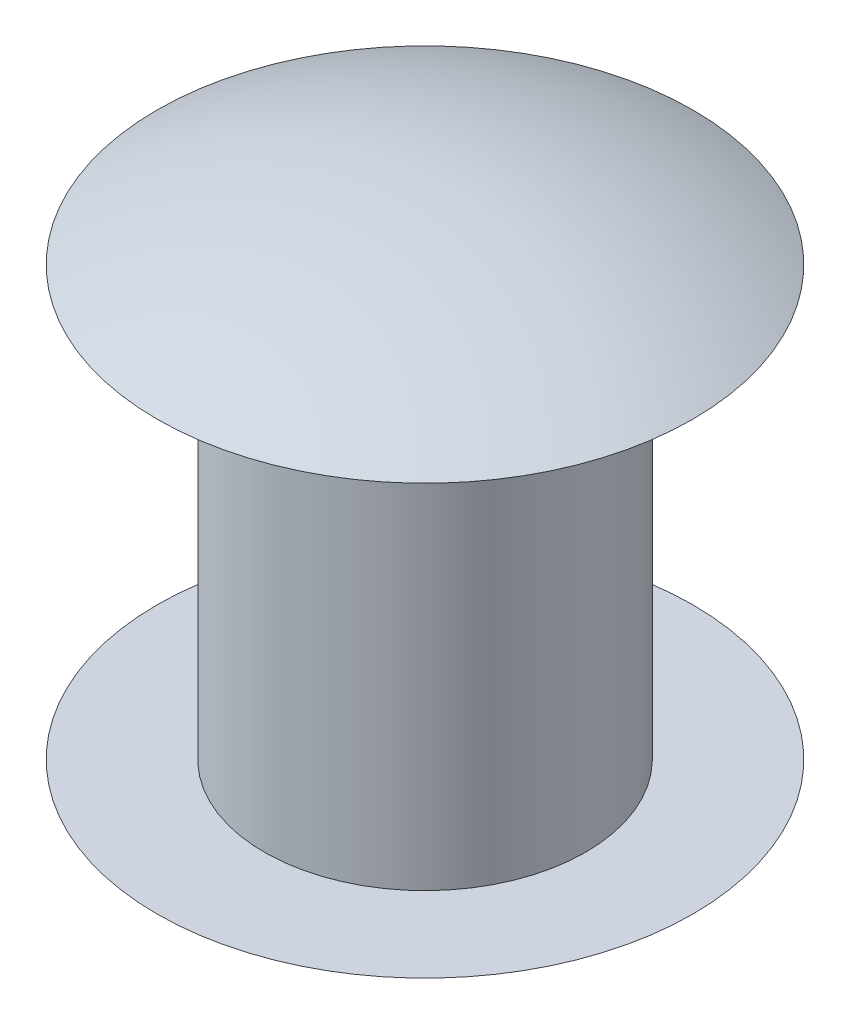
ISO-10303-21;
HEADER;
FILE_DESCRIPTION(('STEP AP214'),'2;1');
FILE_NAME('part.step','',(''),(''),'','','');
FILE_SCHEMA(('AUTOMOTIVE_DESIGN { 1 0 10303 214 1 1 1 1 }'));
ENDSEC;
DATA;
#1=APPLICATION_CONTEXT('core data for automotive mechanical design processes');
#2=APPLICATION_PROTOCOL_DEFINITION('international standard','automotive_design',2000,#1);
#3=PRODUCT_CONTEXT('',#1,'mechanical');
#4=PRODUCT('Part','Part','',(#3));
#5=PRODUCT_RELATED_PRODUCT_CATEGORY('part','',(#4));
#6=PRODUCT_DEFINITION_FORMATION('','',#4);
#7=PRODUCT_DEFINITION_CONTEXT('part definition',#1,'design');
#8=PRODUCT_DEFINITION('design','',#6,#7);
#9=PRODUCT_DEFINITION_SHAPE('','',#8);
#10=(LENGTH_UNIT() NAMED_UNIT(*) SI_UNIT(.MILLI.,.METRE.));
#11=(NAMED_UNIT(*) PLANE_ANGLE_UNIT() SI_UNIT($,.RADIAN.));
#12=(NAMED_UNIT(*) SI_UNIT($,.STERADIAN.) SOLID_ANGLE_UNIT());
#13=UNCERTAINTY_MEASURE_WITH_UNIT(LENGTH_MEASURE(1.E-05),#10,'distance_accuracy_value','');
#14=(GEOMETRIC_REPRESENTATION_CONTEXT(3) GLOBAL_UNCERTAINTY_ASSIGNED_CONTEXT((#13)) GLOBAL_UNIT_ASSIGNED_CONTEXT((#10,
#11,#12)) REPRESENTATION_CONTEXT('',''));
#15=CARTESIAN_POINT('',(0.,0.,0.));
#16=DIRECTION('',(0.,0.,1.));
#17=DIRECTION('',(1.,0.,0.));
#18=AXIS2_PLACEMENT_3D('',#15,#16,#17);
#19=CARTESIAN_POINT('',(0.,-2.90833333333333,0.));
#20=DIRECTION('',(0.,-1.,0.));
#21=DIRECTION('',(1.,0.,0.));
#22=AXIS2_PLACEMENT_3D('',#19,#20,#21);
#23=SPHERICAL_SURFACE('',#22,5.50833333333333);
#24=CARTESIAN_POINT('',(0.,2.,0.));
#25=DIRECTION('',(0.,-1.,0.));
#26=DIRECTION('',(1.,0.,0.));
#27=AXIS2_PLACEMENT_3D('',#24,#25,#26);
#28=CIRCLE('',#27,2.5);
#29=CARTESIAN_POINT('',(2.5,2.,0.));
#30=VERTEX_POINT('',#29);
#31=EDGE_CURVE('E10',#30,#30,#28,.T.);
#32=ORIENTED_EDGE('',*,*,#31,.F.);
#33=EDGE_LOOP('',(#32));
#34=FACE_BOUND('',#33,.T.);
#35=ADVANCED_FACE('F31',(#34),#23,.T.);
#36=CARTESIAN_POINT('',(2.5,2.,0.));
#37=DIRECTION('',(0.,-1.,0.));
#38=DIRECTION('',(1.,0.,0.));
#39=AXIS2_PLACEMENT_3D('',#36,#37,#38);
#40=PLANE('',#39);
#41=ORIENTED_EDGE('',*,*,#31,.T.);
#42=EDGE_LOOP('',(#41));
#43=FACE_BOUND('',#42,.T.);
#44=CARTESIAN_POINT('',(0.,2.,0.));
#45=DIRECTION('',(0.,-1.,0.));
#46=DIRECTION('',(1.,0.,0.));
#47=AXIS2_PLACEMENT_3D('',#44,#45,#46);
#48=CIRCLE('',#47,1.5);
#49=CARTESIAN_POINT('',(1.5,2.,0.));
#50=VERTEX_POINT('',#49);
#51=EDGE_CURVE('E37',#50,#50,#48,.T.);
#52=ORIENTED_EDGE('',*,*,#51,.F.);
#53=EDGE_LOOP('',(#52));
#54=FACE_BOUND('',#53,.T.);
#55=ADVANCED_FACE('F63',(#43,#54),#40,.T.);
#56=CARTESIAN_POINT('',(0.,0.,0.));
#57=DIRECTION('',(0.,-1.,0.));
#58=DIRECTION('',(1.,0.,0.));
#59=AXIS2_PLACEMENT_3D('',#56,#57,#58);
#60=CYLINDRICAL_SURFACE('',#59,1.5);
#61=ORIENTED_EDGE('',*,*,#51,.T.);
#62=EDGE_LOOP('',(#61));
#63=FACE_BOUND('',#62,.T.);
#64=CARTESIAN_POINT('',(0.,-2.,0.));
#65=DIRECTION('',(0.,-1.,0.));
#66=DIRECTION('',(1.,0.,0.));
#67=AXIS2_PLACEMENT_3D('',#64,#65,#66);
#68=CIRCLE('',#67,1.5);
#69=CARTESIAN_POINT('',(1.5,-2.,0.));
#70=VERTEX_POINT('',#69);
#71=EDGE_CURVE('E41',#70,#70,#68,.T.);
#72=ORIENTED_EDGE('',*,*,#71,.F.);
#73=EDGE_LOOP('',(#72));
#74=FACE_BOUND('',#73,.T.);
#75=ADVANCED_FACE('F55',(#63,#74),#60,.T.);
#76=CARTESIAN_POINT('',(1.5,-2.,0.));
#77=DIRECTION('',(0.,1.,0.));
#78=DIRECTION('',(-1.,0.,0.));
#79=AXIS2_PLACEMENT_3D('',#76,#77,#78);
#80=PLANE('',#79);
#81=ORIENTED_EDGE('',*,*,#71,.T.);
#82=EDGE_LOOP('',(#81));
#83=FACE_BOUND('',#82,.T.);
#84=CARTESIAN_POINT('',(0.,-2.,0.));
#85=DIRECTION('',(0.,-1.,0.));
#86=DIRECTION('',(1.,0.,0.));
#87=AXIS2_PLACEMENT_3D('',#84,#85,#86);
#88=CIRCLE('',#87,2.5);
#89=CARTESIAN_POINT('',(2.5,-2.,0.));
#90=VERTEX_POINT('',#89);
#91=EDGE_CURVE('E45',#90,#90,#88,.T.);
#92=ORIENTED_EDGE('',*,*,#91,.F.);
#93=EDGE_LOOP('',(#92));
#94=FACE_BOUND('',#93,.T.);
#95=ADVANCED_FACE('F53',(#83,#94),#80,.T.);
#96=CARTESIAN_POINT('',(0.,2.90833333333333,0.));
#97=DIRECTION('',(0.,-1.,0.));
#98=DIRECTION('',(1.,0.,0.));
#99=AXIS2_PLACEMENT_3D('',#96,#97,#98);
#100=SPHERICAL_SURFACE('',#99,5.50833333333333);
#101=ORIENTED_EDGE('',*,*,#91,.T.);
#102=EDGE_LOOP('',(#101));
#103=FACE_BOUND('',#102,.T.);
#104=ADVANCED_FACE('F51',(#103),#100,.T.);
#105=CLOSED_SHELL('',(#35,#55,#75,#95,#104));
#106=MANIFOLD_SOLID_BREP('B2',#105);
#107=ADVANCED_BREP_SHAPE_REPRESENTATION('',(#18,#106),#14);
#108=SHAPE_DEFINITION_REPRESENTATION(#9,#107);
ENDSEC;
END-ISO-10303-21;
